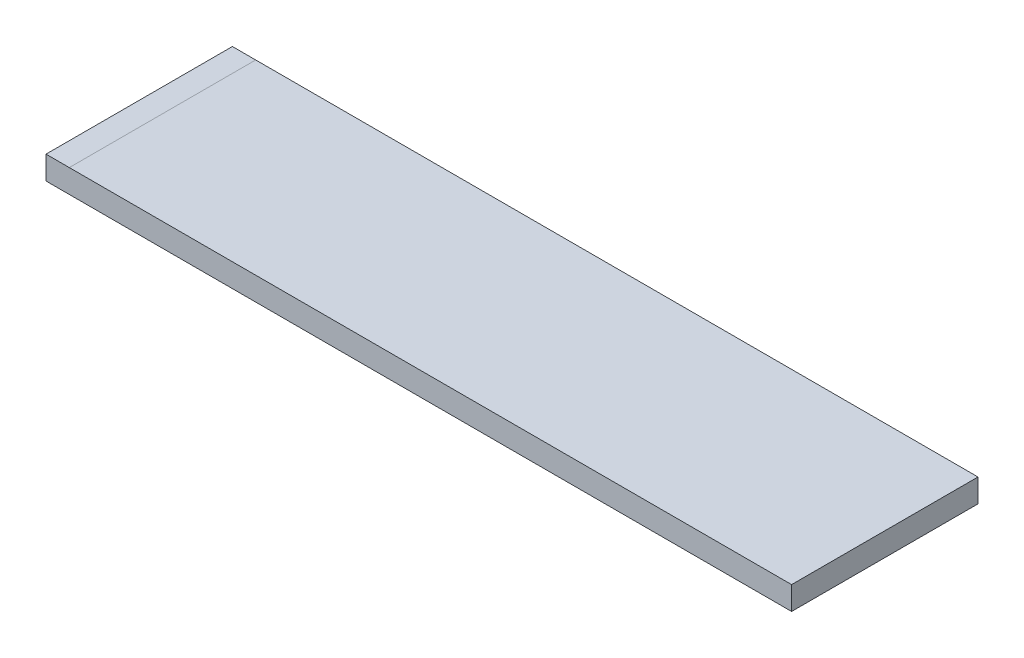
ISO-10303-21;
HEADER;
FILE_DESCRIPTION(('STEP AP214'),'2;1');
FILE_NAME('part.step','',(''),(''),'','','');
FILE_SCHEMA(('AUTOMOTIVE_DESIGN { 1 0 10303 214 1 1 1 1 }'));
ENDSEC;
DATA;
#1=APPLICATION_CONTEXT('core data for automotive mechanical design processes');
#2=APPLICATION_PROTOCOL_DEFINITION('international standard','automotive_design',2000,#1);
#3=PRODUCT_CONTEXT('',#1,'mechanical');
#4=PRODUCT('Part','Part','',(#3));
#5=PRODUCT_RELATED_PRODUCT_CATEGORY('part','',(#4));
#6=PRODUCT_DEFINITION_FORMATION('','',#4);
#7=PRODUCT_DEFINITION_CONTEXT('part definition',#1,'design');
#8=PRODUCT_DEFINITION('design','',#6,#7);
#9=PRODUCT_DEFINITION_SHAPE('','',#8);
#10=(LENGTH_UNIT() NAMED_UNIT(*) SI_UNIT(.MILLI.,.METRE.));
#11=(NAMED_UNIT(*) PLANE_ANGLE_UNIT() SI_UNIT($,.RADIAN.));
#12=(NAMED_UNIT(*) SI_UNIT($,.STERADIAN.) SOLID_ANGLE_UNIT());
#13=UNCERTAINTY_MEASURE_WITH_UNIT(LENGTH_MEASURE(1.E-05),#10,'distance_accuracy_value','');
#14=(GEOMETRIC_REPRESENTATION_CONTEXT(3) GLOBAL_UNCERTAINTY_ASSIGNED_CONTEXT((#13)) GLOBAL_UNIT_ASSIGNED_CONTEXT((#10,
#11,#12)) REPRESENTATION_CONTEXT('',''));
#15=CARTESIAN_POINT('',(0.,0.,0.));
#16=DIRECTION('',(0.,0.,1.));
#17=DIRECTION('',(1.,0.,0.));
#18=AXIS2_PLACEMENT_3D('',#15,#16,#17);
#19=CARTESIAN_POINT('',(0.,0.,25.4));
#20=DIRECTION('',(0.,1.,0.));
#21=DIRECTION('',(0.,0.,1.));
#22=AXIS2_PLACEMENT_3D('',#19,#20,#21);
#23=PLANE('',#22);
#24=DIRECTION('',(1.,0.,0.));
#25=VECTOR('',#24,1.);
#26=CARTESIAN_POINT('',(0.,0.,-25.4));
#27=LINE('',#26,#25);
#28=CARTESIAN_POINT('',(6.35,0.,-25.4));
#29=VERTEX_POINT('',#28);
#30=CARTESIAN_POINT('',(203.2,0.,-25.4));
#31=VERTEX_POINT('',#30);
#32=EDGE_CURVE('E114',#29,#31,#27,.T.);
#33=ORIENTED_EDGE('',*,*,#32,.F.);
#34=DIRECTION('',(0.,0.,1.));
#35=VECTOR('',#34,1.);
#36=CARTESIAN_POINT('',(6.35000000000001,0.,25.4));
#37=LINE('',#36,#35);
#38=CARTESIAN_POINT('',(6.35,0.,25.4));
#39=VERTEX_POINT('',#38);
#40=EDGE_CURVE('E11',#29,#39,#37,.T.);
#41=ORIENTED_EDGE('',*,*,#40,.T.);
#42=DIRECTION('',(1.,0.,0.));
#43=VECTOR('',#42,1.);
#44=CARTESIAN_POINT('',(0.,0.,25.4));
#45=LINE('',#44,#43);
#46=CARTESIAN_POINT('',(203.2,0.,25.4));
#47=VERTEX_POINT('',#46);
#48=EDGE_CURVE('E104',#39,#47,#45,.T.);
#49=ORIENTED_EDGE('',*,*,#48,.T.);
#50=DIRECTION('',(0.,0.,-1.));
#51=VECTOR('',#50,1.);
#52=CARTESIAN_POINT('',(203.2,0.,25.4));
#53=LINE('',#52,#51);
#54=EDGE_CURVE('E100',#47,#31,#53,.T.);
#55=ORIENTED_EDGE('',*,*,#54,.T.);
#56=EDGE_LOOP('',(#33,#41,#49,#55));
#57=FACE_BOUND('',#56,.T.);
#58=ADVANCED_FACE('F37',(#57),#23,.T.);
#59=CARTESIAN_POINT('',(0.,-6.35,25.4));
#60=DIRECTION('',(0.,1.,0.));
#61=DIRECTION('',(0.,0.,1.));
#62=AXIS2_PLACEMENT_3D('',#59,#60,#61);
#63=PLANE('',#62);
#64=DIRECTION('',(1.,0.,0.));
#65=VECTOR('',#64,1.);
#66=CARTESIAN_POINT('',(0.,-6.35,-25.4));
#67=LINE('',#66,#65);
#68=CARTESIAN_POINT('',(0.,-6.35,-25.4));
#69=VERTEX_POINT('',#68);
#70=CARTESIAN_POINT('',(203.2,-6.35,-25.4));
#71=VERTEX_POINT('',#70);
#72=EDGE_CURVE('E96',#69,#71,#67,.T.);
#73=ORIENTED_EDGE('',*,*,#72,.T.);
#74=DIRECTION('',(0.,0.,-1.));
#75=VECTOR('',#74,1.);
#76=CARTESIAN_POINT('',(203.2,-6.35,25.4));
#77=LINE('',#76,#75);
#78=CARTESIAN_POINT('',(203.2,-6.35,25.4));
#79=VERTEX_POINT('',#78);
#80=EDGE_CURVE('E46',#79,#71,#77,.T.);
#81=ORIENTED_EDGE('',*,*,#80,.F.);
#82=DIRECTION('',(1.,0.,0.));
#83=VECTOR('',#82,1.);
#84=CARTESIAN_POINT('',(0.,-6.35,25.4));
#85=LINE('',#84,#83);
#86=CARTESIAN_POINT('',(0.,-6.35,25.4));
#87=VERTEX_POINT('',#86);
#88=EDGE_CURVE('E83',#87,#79,#85,.T.);
#89=ORIENTED_EDGE('',*,*,#88,.F.);
#90=DIRECTION('',(0.,0.,-1.));
#91=VECTOR('',#90,1.);
#92=CARTESIAN_POINT('',(0.,-6.35,25.4));
#93=LINE('',#92,#91);
#94=EDGE_CURVE('E110',#87,#69,#93,.T.);
#95=ORIENTED_EDGE('',*,*,#94,.T.);
#96=EDGE_LOOP('',(#73,#81,#89,#95));
#97=FACE_BOUND('',#96,.T.);
#98=ADVANCED_FACE('F39',(#97),#63,.F.);
#99=CARTESIAN_POINT('',(203.2,0.,25.4));
#100=DIRECTION('',(1.,0.,0.));
#101=DIRECTION('',(0.,0.,-1.));
#102=AXIS2_PLACEMENT_3D('',#99,#100,#101);
#103=PLANE('',#102);
#104=DIRECTION('',(0.,-1.,0.));
#105=VECTOR('',#104,1.);
#106=CARTESIAN_POINT('',(203.2,0.,-25.4));
#107=LINE('',#106,#105);
#108=EDGE_CURVE('E112',#31,#71,#107,.T.);
#109=ORIENTED_EDGE('',*,*,#108,.F.);
#110=ORIENTED_EDGE('',*,*,#54,.F.);
#111=DIRECTION('',(0.,-1.,0.));
#112=VECTOR('',#111,1.);
#113=CARTESIAN_POINT('',(203.2,0.,25.4));
#114=LINE('',#113,#112);
#115=EDGE_CURVE('E87',#47,#79,#114,.T.);
#116=ORIENTED_EDGE('',*,*,#115,.T.);
#117=ORIENTED_EDGE('',*,*,#80,.T.);
#118=EDGE_LOOP('',(#109,#110,#116,#117));
#119=FACE_BOUND('',#118,.T.);
#120=ADVANCED_FACE('F102',(#119),#103,.T.);
#121=ORIENTED_EDGE('',*,*,#40,.F.);
#122=CARTESIAN_POINT('',(0.,0.,-25.4));
#123=VERTEX_POINT('',#122);
#124=EDGE_CURVE('E115',#123,#29,#27,.T.);
#125=ORIENTED_EDGE('',*,*,#124,.F.);
#126=DIRECTION('',(0.,0.,-1.));
#127=VECTOR('',#126,1.);
#128=CARTESIAN_POINT('',(0.,0.,25.4));
#129=LINE('',#128,#127);
#130=CARTESIAN_POINT('',(0.,0.,25.4));
#131=VERTEX_POINT('',#130);
#132=EDGE_CURVE('E121',#131,#123,#129,.T.);
#133=ORIENTED_EDGE('',*,*,#132,.F.);
#134=EDGE_CURVE('E106',#131,#39,#45,.T.);
#135=ORIENTED_EDGE('',*,*,#134,.T.);
#136=EDGE_LOOP('',(#121,#125,#133,#135));
#137=FACE_BOUND('',#136,.T.);
#138=ADVANCED_FACE('F126',(#137),#23,.T.);
#139=CARTESIAN_POINT('',(0.,-6.35,25.4));
#140=DIRECTION('',(-1.,0.,0.));
#141=DIRECTION('',(0.,0.,1.));
#142=AXIS2_PLACEMENT_3D('',#139,#140,#141);
#143=PLANE('',#142);
#144=DIRECTION('',(0.,1.,0.));
#145=VECTOR('',#144,1.);
#146=CARTESIAN_POINT('',(0.,-6.35,-25.4));
#147=LINE('',#146,#145);
#148=EDGE_CURVE('E92',#69,#123,#147,.T.);
#149=ORIENTED_EDGE('',*,*,#148,.F.);
#150=ORIENTED_EDGE('',*,*,#94,.F.);
#151=DIRECTION('',(0.,1.,0.));
#152=VECTOR('',#151,1.);
#153=CARTESIAN_POINT('',(0.,-6.35,25.4));
#154=LINE('',#153,#152);
#155=EDGE_CURVE('E90',#87,#131,#154,.T.);
#156=ORIENTED_EDGE('',*,*,#155,.T.);
#157=ORIENTED_EDGE('',*,*,#132,.T.);
#158=EDGE_LOOP('',(#149,#150,#156,#157));
#159=FACE_BOUND('',#158,.T.);
#160=ADVANCED_FACE('F128',(#159),#143,.T.);
#161=CARTESIAN_POINT('',(203.2,-6.35,25.4));
#162=DIRECTION('',(0.,0.,-1.));
#163=DIRECTION('',(-1.,0.,0.));
#164=AXIS2_PLACEMENT_3D('',#161,#162,#163);
#165=PLANE('',#164);
#166=ORIENTED_EDGE('',*,*,#88,.T.);
#167=ORIENTED_EDGE('',*,*,#115,.F.);
#168=ORIENTED_EDGE('',*,*,#48,.F.);
#169=ORIENTED_EDGE('',*,*,#134,.F.);
#170=ORIENTED_EDGE('',*,*,#155,.F.);
#171=EDGE_LOOP('',(#166,#167,#168,#169,#170));
#172=FACE_BOUND('',#171,.T.);
#173=ADVANCED_FACE('F85',(#172),#165,.F.);
#174=CARTESIAN_POINT('',(203.2,-6.35,-25.4));
#175=DIRECTION('',(0.,0.,-1.));
#176=DIRECTION('',(-1.,0.,0.));
#177=AXIS2_PLACEMENT_3D('',#174,#175,#176);
#178=PLANE('',#177);
#179=ORIENTED_EDGE('',*,*,#72,.F.);
#180=ORIENTED_EDGE('',*,*,#148,.T.);
#181=ORIENTED_EDGE('',*,*,#124,.T.);
#182=ORIENTED_EDGE('',*,*,#32,.T.);
#183=ORIENTED_EDGE('',*,*,#108,.T.);
#184=EDGE_LOOP('',(#179,#180,#181,#182,#183));
#185=FACE_BOUND('',#184,.T.);
#186=ADVANCED_FACE('F124',(#185),#178,.T.);
#187=CLOSED_SHELL('',(#58,#98,#120,#138,#160,#173,#186));
#188=MANIFOLD_SOLID_BREP('B2',#187);
#189=ADVANCED_BREP_SHAPE_REPRESENTATION('',(#18,#188),#14);
#190=SHAPE_DEFINITION_REPRESENTATION(#9,#189);
ENDSEC;
END-ISO-10303-21;
